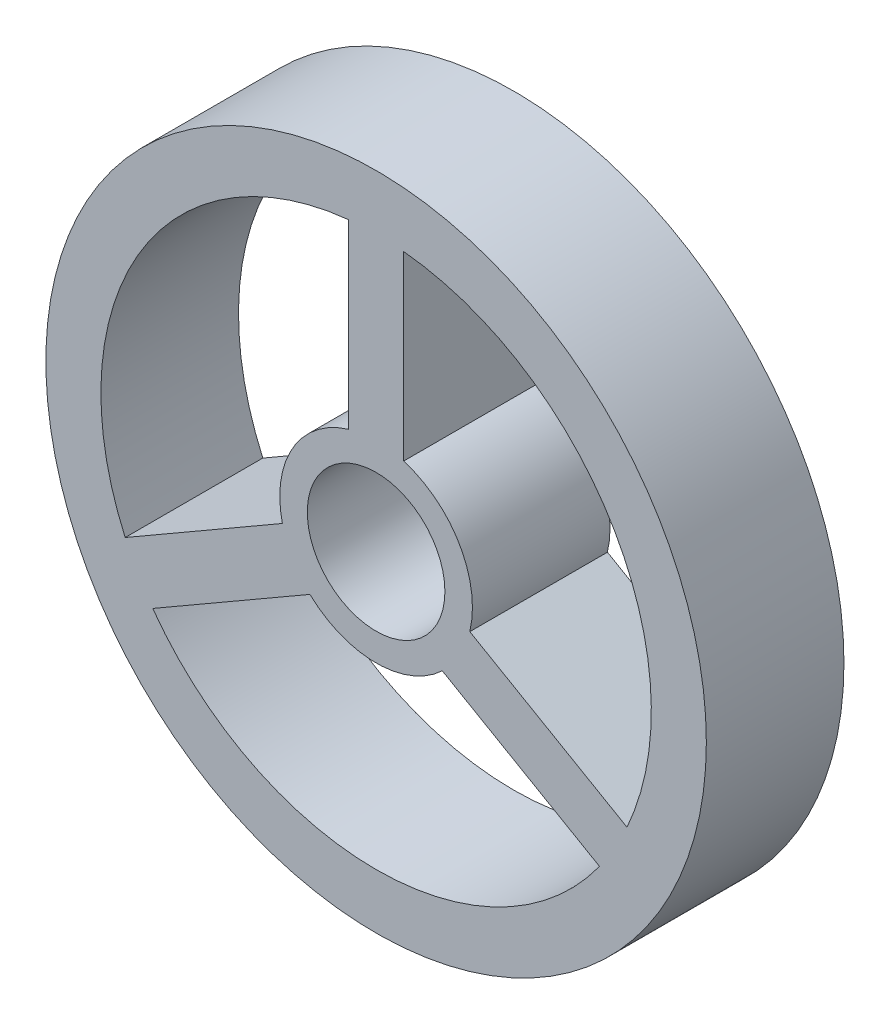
from build123d import *

# Parameters (mm, degrees)
SKIZZE1_R               = 12
SKIZZE1_R_2             = 2.5
LINEAR_AUSTRAGEN1_DEPTH = 5


with BuildPart() as part:
    # Skizze1 → Linear austragen1 (new body)
    with BuildSketch(Plane.XY):
        Circle(SKIZZE1_R)
        Circle(SKIZZE1_R_2, mode=Mode.SUBTRACT)
        with BuildLine():
            Line((-1, 9.949874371), (-1, 3.354101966))
            ThreePointArc((-1, 3.354101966), (-3.031088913, 1.75), (-3.40473751, -0.811025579))
            Line((-3.40473751, -0.811025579), (-9.11684397, -4.108911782))
            ThreePointArc((-9.11684397, -4.108911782), (-8.660254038, 5), (-1, 9.949874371))
        make_face(mode=Mode.SUBTRACT)
        with BuildLine():
            Line((1, 9.949874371), (1, 3.354101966))
            ThreePointArc((1, 3.354101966), (3.031088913, 1.75), (3.40473751, -0.811025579))
            Line((3.40473751, -0.811025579), (9.11684397, -4.108911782))
            ThreePointArc((9.11684397, -4.108911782), (8.660254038, 5), (1, 9.949874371))
        make_face(mode=Mode.SUBTRACT)
        with BuildLine():
            Line((8.11684397, -5.840962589), (2.40473751, -2.543076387))
            ThreePointArc((2.40473751, -2.543076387), (0, -3.5), (-2.40473751, -2.543076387))
            Line((-2.40473751, -2.543076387), (-8.11684397, -5.840962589))
            ThreePointArc((-8.11684397, -5.840962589), (0, -10), (8.11684397, -5.840962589))
        make_face(mode=Mode.SUBTRACT)
    extrude(amount=LINEAR_AUSTRAGEN1_DEPTH)


solid = part.part
